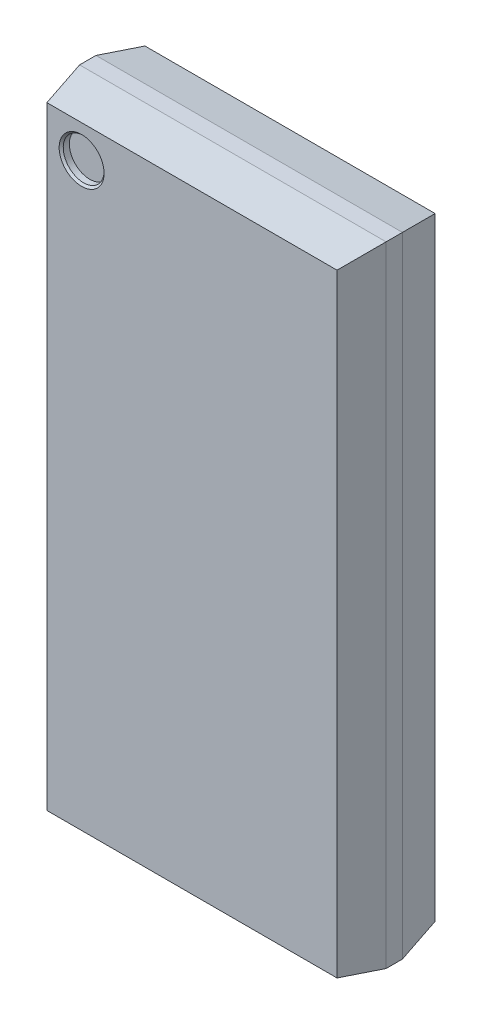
ISO-10303-21;
HEADER;
FILE_DESCRIPTION(('STEP AP214'),'2;1');
FILE_NAME('part.step','',(''),(''),'','','');
FILE_SCHEMA(('AUTOMOTIVE_DESIGN { 1 0 10303 214 1 1 1 1 }'));
ENDSEC;
DATA;
#1=APPLICATION_CONTEXT('core data for automotive mechanical design processes');
#2=APPLICATION_PROTOCOL_DEFINITION('international standard','automotive_design',2000,#1);
#3=PRODUCT_CONTEXT('',#1,'mechanical');
#4=PRODUCT('Part','Part','',(#3));
#5=PRODUCT_RELATED_PRODUCT_CATEGORY('part','',(#4));
#6=PRODUCT_DEFINITION_FORMATION('','',#4);
#7=PRODUCT_DEFINITION_CONTEXT('part definition',#1,'design');
#8=PRODUCT_DEFINITION('design','',#6,#7);
#9=PRODUCT_DEFINITION_SHAPE('','',#8);
#10=(LENGTH_UNIT() NAMED_UNIT(*) SI_UNIT(.MILLI.,.METRE.));
#11=(NAMED_UNIT(*) PLANE_ANGLE_UNIT() SI_UNIT($,.RADIAN.));
#12=(NAMED_UNIT(*) SI_UNIT($,.STERADIAN.) SOLID_ANGLE_UNIT());
#13=UNCERTAINTY_MEASURE_WITH_UNIT(LENGTH_MEASURE(1.E-05),#10,'distance_accuracy_value','');
#14=(GEOMETRIC_REPRESENTATION_CONTEXT(3) GLOBAL_UNCERTAINTY_ASSIGNED_CONTEXT((#13)) GLOBAL_UNIT_ASSIGNED_CONTEXT((#10,
#11,#12)) REPRESENTATION_CONTEXT('',''));
#15=CARTESIAN_POINT('',(0.,0.,0.));
#16=DIRECTION('',(0.,0.,1.));
#17=DIRECTION('',(1.,0.,0.));
#18=AXIS2_PLACEMENT_3D('',#15,#16,#17);
#19=CARTESIAN_POINT('',(-2.7000000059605,6.5649999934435,2.4));
#20=DIRECTION('',(0.,0.,1.));
#21=DIRECTION('',(1.,0.,0.));
#22=AXIS2_PLACEMENT_3D('',#19,#20,#21);
#23=PLANE('',#22);
#24=CARTESIAN_POINT('',(-2.7000000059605,6.5649999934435,2.4));
#25=DIRECTION('',(0.,0.,1.));
#26=DIRECTION('',(1.,0.,0.));
#27=AXIS2_PLACEMENT_3D('',#24,#25,#26);
#28=CIRCLE('',#27,0.5);
#29=CARTESIAN_POINT('',(-2.2000000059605,6.5649999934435,2.4));
#30=VERTEX_POINT('',#29);
#31=EDGE_CURVE('E20',#30,#30,#28,.T.);
#32=ORIENTED_EDGE('',*,*,#31,.T.);
#33=EDGE_LOOP('',(#32));
#34=FACE_BOUND('',#33,.T.);
#35=ADVANCED_FACE('F17',(#34),#23,.T.);
#36=CARTESIAN_POINT('',(-2.7000000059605,6.5649999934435,2.4));
#37=DIRECTION('',(0.,0.,1.));
#38=DIRECTION('',(1.,0.,0.));
#39=AXIS2_PLACEMENT_3D('',#36,#37,#38);
#40=CYLINDRICAL_SURFACE('',#39,0.5);
#41=CARTESIAN_POINT('',(-2.7000000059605,6.5649999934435,2.55000009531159));
#42=DIRECTION('',(0.,0.,1.));
#43=DIRECTION('',(0.,-1.,0.));
#44=AXIS2_PLACEMENT_3D('',#41,#42,#43);
#45=CIRCLE('',#44,0.499999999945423);
#46=CARTESIAN_POINT('',(-2.7000000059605,6.06499999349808,2.55000009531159));
#47=VERTEX_POINT('',#46);
#48=EDGE_CURVE('E111',#47,#47,#45,.T.);
#49=ORIENTED_EDGE('',*,*,#48,.T.);
#50=EDGE_LOOP('',(#49));
#51=FACE_BOUND('',#50,.T.);
#52=ORIENTED_EDGE('',*,*,#31,.F.);
#53=EDGE_LOOP('',(#52));
#54=FACE_BOUND('',#53,.T.);
#55=ADVANCED_FACE('F122',(#51,#54),#40,.F.);
#56=CARTESIAN_POINT('',(-2.7000000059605,6.5649999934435,2.60000009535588));
#57=DIRECTION('',(0.,0.,1.));
#58=DIRECTION('',(1.,0.,0.));
#59=AXIS2_PLACEMENT_3D('',#56,#57,#58);
#60=CONICAL_SURFACE('',#59,0.550000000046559,0.785398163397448);
#61=CARTESIAN_POINT('',(-2.7000000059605,6.5649999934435,2.60000009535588));
#62=DIRECTION('',(0.,0.,1.));
#63=DIRECTION('',(1.,0.,0.));
#64=AXIS2_PLACEMENT_3D('',#61,#62,#63);
#65=CIRCLE('',#64,0.550000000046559);
#66=CARTESIAN_POINT('',(-2.15000000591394,6.5649999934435,2.60000009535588));
#67=VERTEX_POINT('',#66);
#68=EDGE_CURVE('E101',#67,#67,#65,.F.);
#69=ORIENTED_EDGE('',*,*,#68,.F.);
#70=EDGE_LOOP('',(#69));
#71=FACE_BOUND('',#70,.T.);
#72=ORIENTED_EDGE('',*,*,#48,.F.);
#73=EDGE_LOOP('',(#72));
#74=FACE_BOUND('',#73,.T.);
#75=ADVANCED_FACE('F119',(#71,#74),#60,.F.);
#76=CARTESIAN_POINT('',(-3.7500000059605,7.5649999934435,2.600000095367));
#77=DIRECTION('',(0.,0.,1.));
#78=DIRECTION('',(1.,0.,0.));
#79=AXIS2_PLACEMENT_3D('',#76,#77,#78);
#80=PLANE('',#79);
#81=ORIENTED_EDGE('',*,*,#68,.T.);
#82=EDGE_LOOP('',(#81));
#83=FACE_BOUND('',#82,.T.);
#84=DIRECTION('',(0.,1.,0.));
#85=VECTOR('',#84,1.);
#86=CARTESIAN_POINT('',(-3.5500000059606,7.5649999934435,2.60000009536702));
#87=LINE('',#86,#85);
#88=CARTESIAN_POINT('',(-3.55000000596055,7.36499999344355,2.60000009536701));
#89=VERTEX_POINT('',#88);
#90=CARTESIAN_POINT('',(-3.55000000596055,-7.63499962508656,2.60000009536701));
#91=VERTEX_POINT('',#90);
#92=EDGE_CURVE('E97',#89,#91,#87,.F.);
#93=ORIENTED_EDGE('',*,*,#92,.T.);
#94=DIRECTION('',(1.,0.,0.));
#95=VECTOR('',#94,1.);
#96=CARTESIAN_POINT('',(-3.5500000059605,-7.6349996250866,2.60000009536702));
#97=LINE('',#96,#95);
#98=CARTESIAN_POINT('',(3.54999999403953,-7.63499962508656,2.60000009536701));
#99=VERTEX_POINT('',#98);
#100=EDGE_CURVE('E93',#99,#91,#97,.F.);
#101=ORIENTED_EDGE('',*,*,#100,.F.);
#102=DIRECTION('',(0.,1.,0.));
#103=VECTOR('',#102,1.);
#104=CARTESIAN_POINT('',(3.5499999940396,7.5649999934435,2.60000009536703));
#105=LINE('',#104,#103);
#106=CARTESIAN_POINT('',(3.54999999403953,7.36499999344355,2.60000009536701));
#107=VERTEX_POINT('',#106);
#108=EDGE_CURVE('E84',#107,#99,#105,.F.);
#109=ORIENTED_EDGE('',*,*,#108,.F.);
#110=DIRECTION('',(1.,0.,0.));
#111=VECTOR('',#110,1.);
#112=CARTESIAN_POINT('',(-3.5500000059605,7.3649999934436,2.60000009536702));
#113=LINE('',#112,#111);
#114=EDGE_CURVE('E79',#107,#89,#113,.F.);
#115=ORIENTED_EDGE('',*,*,#114,.T.);
#116=EDGE_LOOP('',(#93,#101,#109,#115));
#117=FACE_BOUND('',#116,.T.);
#118=ADVANCED_FACE('F96',(#83,#117),#80,.T.);
#119=CARTESIAN_POINT('',(-3.5500000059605,-7.7349996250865,2.100000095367));
#120=DIRECTION('',(0.,-0.980580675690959,0.196116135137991));
#121=DIRECTION('',(0.,-0.196116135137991,-0.980580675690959));
#122=AXIS2_PLACEMENT_3D('',#119,#120,#121);
#123=PLANE('',#122);
#124=DIRECTION('',(1.,0.,0.));
#125=VECTOR('',#124,1.);
#126=CARTESIAN_POINT('',(-3.7500000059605,-7.8349996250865,1.60000009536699));
#127=LINE('',#126,#125);
#128=CARTESIAN_POINT('',(3.74999999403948,-7.83499962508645,1.60000009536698));
#129=VERTEX_POINT('',#128);
#130=CARTESIAN_POINT('',(-3.75000000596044,-7.83499962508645,1.60000009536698));
#131=VERTEX_POINT('',#130);
#132=EDGE_CURVE('E105',#129,#131,#127,.F.);
#133=ORIENTED_EDGE('',*,*,#132,.F.);
#134=DIRECTION('',(0.192450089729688,-0.192450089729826,-0.962250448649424));
#135=VECTOR('',#134,1.);
#136=CARTESIAN_POINT('',(3.5499999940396,-7.63499962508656,2.60000009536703));
#137=LINE('',#136,#135);
#138=EDGE_CURVE('E89',#99,#129,#137,.T.);
#139=ORIENTED_EDGE('',*,*,#138,.F.);
#140=ORIENTED_EDGE('',*,*,#100,.T.);
#141=DIRECTION('',(-0.192450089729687,-0.192450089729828,-0.962250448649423));
#142=VECTOR('',#141,1.);
#143=CARTESIAN_POINT('',(-3.5500000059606,-7.63499962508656,2.60000009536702));
#144=LINE('',#143,#142);
#145=EDGE_CURVE('E362',#91,#131,#144,.T.);
#146=ORIENTED_EDGE('',*,*,#145,.T.);
#147=EDGE_LOOP('',(#133,#139,#140,#146));
#148=FACE_BOUND('',#147,.T.);
#149=ADVANCED_FACE('F104',(#148),#123,.T.);
#150=CARTESIAN_POINT('',(3.6499999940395,7.5649999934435,2.100000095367));
#151=DIRECTION('',(0.980580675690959,0.,0.196116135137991));
#152=DIRECTION('',(0.196116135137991,0.,-0.980580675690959));
#153=AXIS2_PLACEMENT_3D('',#150,#151,#152);
#154=PLANE('',#153);
#155=ORIENTED_EDGE('',*,*,#138,.T.);
#156=DIRECTION('',(0.,1.,0.));
#157=VECTOR('',#156,1.);
#158=CARTESIAN_POINT('',(3.7499999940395,7.5649999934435,1.60000009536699));
#159=LINE('',#158,#157);
#160=CARTESIAN_POINT('',(3.74999999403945,7.56499999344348,1.60000009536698));
#161=VERTEX_POINT('',#160);
#162=EDGE_CURVE('E358',#161,#129,#159,.F.);
#163=ORIENTED_EDGE('',*,*,#162,.F.);
#164=DIRECTION('',(-0.192450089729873,-0.192450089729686,0.962250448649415));
#165=VECTOR('',#164,1.);
#166=CARTESIAN_POINT('',(3.7499999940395,7.5649999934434,1.60000009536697));
#167=LINE('',#166,#165);
#168=EDGE_CURVE('E91',#161,#107,#167,.T.);
#169=ORIENTED_EDGE('',*,*,#168,.T.);
#170=ORIENTED_EDGE('',*,*,#108,.T.);
#171=EDGE_LOOP('',(#155,#163,#169,#170));
#172=FACE_BOUND('',#171,.T.);
#173=ADVANCED_FACE('F86',(#172),#154,.T.);
#174=CARTESIAN_POINT('',(-3.5500000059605,7.4649999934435,2.100000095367));
#175=DIRECTION('',(0.,-0.980580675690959,-0.196116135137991));
#176=DIRECTION('',(0.,0.196116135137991,-0.980580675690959));
#177=AXIS2_PLACEMENT_3D('',#174,#175,#176);
#178=PLANE('',#177);
#179=DIRECTION('',(1.,0.,0.));
#180=VECTOR('',#179,1.);
#181=CARTESIAN_POINT('',(-3.7500000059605,7.5649999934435,1.60000009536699));
#182=LINE('',#181,#180);
#183=CARTESIAN_POINT('',(-3.75000000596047,7.56499999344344,1.60000009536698));
#184=VERTEX_POINT('',#183);
#185=EDGE_CURVE('E330',#161,#184,#182,.F.);
#186=ORIENTED_EDGE('',*,*,#185,.T.);
#187=DIRECTION('',(0.192450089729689,-0.192450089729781,0.962250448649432));
#188=VECTOR('',#187,1.);
#189=CARTESIAN_POINT('',(-3.7500000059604,7.56499999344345,1.60000009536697));
#190=LINE('',#189,#188);
#191=EDGE_CURVE('E332',#184,#89,#190,.T.);
#192=ORIENTED_EDGE('',*,*,#191,.T.);
#193=ORIENTED_EDGE('',*,*,#114,.F.);
#194=ORIENTED_EDGE('',*,*,#168,.F.);
#195=EDGE_LOOP('',(#186,#192,#193,#194));
#196=FACE_BOUND('',#195,.T.);
#197=ADVANCED_FACE('F177',(#196),#178,.F.);
#198=CARTESIAN_POINT('',(-3.6500000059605,7.5649999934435,2.100000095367));
#199=DIRECTION('',(0.980580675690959,0.,-0.196116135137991));
#200=DIRECTION('',(-0.196116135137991,0.,-0.980580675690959));
#201=AXIS2_PLACEMENT_3D('',#198,#199,#200);
#202=PLANE('',#201);
#203=DIRECTION('',(0.,1.,0.));
#204=VECTOR('',#203,1.);
#205=CARTESIAN_POINT('',(-3.7500000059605,7.5649999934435,1.60000009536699));
#206=LINE('',#205,#204);
#207=EDGE_CURVE('E334',#184,#131,#206,.F.);
#208=ORIENTED_EDGE('',*,*,#207,.T.);
#209=ORIENTED_EDGE('',*,*,#145,.F.);
#210=ORIENTED_EDGE('',*,*,#92,.F.);
#211=ORIENTED_EDGE('',*,*,#191,.F.);
#212=EDGE_LOOP('',(#208,#209,#210,#211));
#213=FACE_BOUND('',#212,.T.);
#214=ADVANCED_FACE('F173',(#213),#202,.F.);
#215=CARTESIAN_POINT('',(-3.7500000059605,-7.8349996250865,0.2));
#216=DIRECTION('',(0.,-1.,0.));
#217=DIRECTION('',(1.,0.,0.));
#218=AXIS2_PLACEMENT_3D('',#215,#216,#217);
#219=PLANE('',#218);
#220=DIRECTION('',(1.,0.,0.));
#221=VECTOR('',#220,1.);
#222=CARTESIAN_POINT('',(-3.5500000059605,-7.8349996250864,1.20000000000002));
#223=LINE('',#222,#221);
#224=CARTESIAN_POINT('',(-3.75000000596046,-7.83499962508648,1.20000000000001));
#225=VERTEX_POINT('',#224);
#226=CARTESIAN_POINT('',(3.74999999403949,-7.83499962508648,1.20000000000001));
#227=VERTEX_POINT('',#226);
#228=EDGE_CURVE('E343',#225,#227,#223,.T.);
#229=ORIENTED_EDGE('',*,*,#228,.T.);
#230=DIRECTION('',(0.,0.,1.));
#231=VECTOR('',#230,1.);
#232=CARTESIAN_POINT('',(3.7499999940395,-7.8349996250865,0.2));
#233=LINE('',#232,#231);
#234=EDGE_CURVE('E356',#129,#227,#233,.F.);
#235=ORIENTED_EDGE('',*,*,#234,.F.);
#236=ORIENTED_EDGE('',*,*,#132,.T.);
#237=DIRECTION('',(0.,0.,1.));
#238=VECTOR('',#237,1.);
#239=CARTESIAN_POINT('',(-3.7500000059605,-7.8349996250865,0.2));
#240=LINE('',#239,#238);
#241=EDGE_CURVE('E344',#131,#225,#240,.F.);
#242=ORIENTED_EDGE('',*,*,#241,.T.);
#243=EDGE_LOOP('',(#229,#235,#236,#242));
#244=FACE_BOUND('',#243,.T.);
#245=ADVANCED_FACE('F169',(#244),#219,.T.);
#246=CARTESIAN_POINT('',(3.7499999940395,7.5649999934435,0.2));
#247=DIRECTION('',(1.,0.,0.));
#248=DIRECTION('',(0.,1.,0.));
#249=AXIS2_PLACEMENT_3D('',#246,#247,#248);
#250=PLANE('',#249);
#251=ORIENTED_EDGE('',*,*,#234,.T.);
#252=DIRECTION('',(0.,1.,0.));
#253=VECTOR('',#252,1.);
#254=CARTESIAN_POINT('',(3.7499999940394,7.5649999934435,1.20000000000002));
#255=LINE('',#254,#253);
#256=CARTESIAN_POINT('',(3.74999999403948,7.56499999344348,1.20000000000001));
#257=VERTEX_POINT('',#256);
#258=EDGE_CURVE('E368',#227,#257,#255,.T.);
#259=ORIENTED_EDGE('',*,*,#258,.T.);
#260=DIRECTION('',(0.,0.,1.));
#261=VECTOR('',#260,1.);
#262=CARTESIAN_POINT('',(3.7499999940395,7.5649999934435,0.2));
#263=LINE('',#262,#261);
#264=EDGE_CURVE('E335',#257,#161,#263,.T.);
#265=ORIENTED_EDGE('',*,*,#264,.T.);
#266=ORIENTED_EDGE('',*,*,#162,.T.);
#267=EDGE_LOOP('',(#251,#259,#265,#266));
#268=FACE_BOUND('',#267,.T.);
#269=ADVANCED_FACE('F165',(#268),#250,.T.);
#270=CARTESIAN_POINT('',(-3.7500000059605,7.5649999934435,0.2));
#271=DIRECTION('',(0.,-1.,0.));
#272=DIRECTION('',(1.,0.,0.));
#273=AXIS2_PLACEMENT_3D('',#270,#271,#272);
#274=PLANE('',#273);
#275=ORIENTED_EDGE('',*,*,#264,.F.);
#276=DIRECTION('',(1.,0.,0.));
#277=VECTOR('',#276,1.);
#278=CARTESIAN_POINT('',(-3.5500000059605,7.5649999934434,1.20000000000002));
#279=LINE('',#278,#277);
#280=CARTESIAN_POINT('',(-3.75000000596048,7.56499999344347,1.20000000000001));
#281=VERTEX_POINT('',#280);
#282=EDGE_CURVE('E340',#281,#257,#279,.T.);
#283=ORIENTED_EDGE('',*,*,#282,.F.);
#284=DIRECTION('',(0.,0.,1.));
#285=VECTOR('',#284,1.);
#286=CARTESIAN_POINT('',(-3.7500000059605,7.56499999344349,0.2));
#287=LINE('',#286,#285);
#288=EDGE_CURVE('E338',#281,#184,#287,.T.);
#289=ORIENTED_EDGE('',*,*,#288,.T.);
#290=ORIENTED_EDGE('',*,*,#185,.F.);
#291=EDGE_LOOP('',(#275,#283,#289,#290));
#292=FACE_BOUND('',#291,.T.);
#293=ADVANCED_FACE('F161',(#292),#274,.F.);
#294=CARTESIAN_POINT('',(-3.7500000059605,7.5649999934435,0.2));
#295=DIRECTION('',(1.,0.,0.));
#296=DIRECTION('',(0.,1.,0.));
#297=AXIS2_PLACEMENT_3D('',#294,#295,#296);
#298=PLANE('',#297);
#299=DIRECTION('',(0.,1.,0.));
#300=VECTOR('',#299,1.);
#301=CARTESIAN_POINT('',(-3.7500000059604,7.5649999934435,1.20000000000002));
#302=LINE('',#301,#300);
#303=EDGE_CURVE('E365',#225,#281,#302,.T.);
#304=ORIENTED_EDGE('',*,*,#303,.F.);
#305=ORIENTED_EDGE('',*,*,#241,.F.);
#306=ORIENTED_EDGE('',*,*,#207,.F.);
#307=ORIENTED_EDGE('',*,*,#288,.F.);
#308=EDGE_LOOP('',(#304,#305,#306,#307));
#309=FACE_BOUND('',#308,.T.);
#310=ADVANCED_FACE('F157',(#309),#298,.F.);
#311=CARTESIAN_POINT('',(-3.5500000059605,-7.7349996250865,0.7));
#312=DIRECTION('',(0.,0.980580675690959,0.196116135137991));
#313=DIRECTION('',(0.,-0.196116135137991,0.980580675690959));
#314=AXIS2_PLACEMENT_3D('',#311,#312,#313);
#315=PLANE('',#314);
#316=DIRECTION('',(0.192450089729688,-0.192450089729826,0.962250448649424));
#317=VECTOR('',#316,1.);
#318=CARTESIAN_POINT('',(3.5499999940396,-7.63499962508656,0.199999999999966));
#319=LINE('',#318,#317);
#320=CARTESIAN_POINT('',(3.54999999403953,-7.63499962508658,0.19999999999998));
#321=VERTEX_POINT('',#320);
#322=EDGE_CURVE('E347',#321,#227,#319,.T.);
#323=ORIENTED_EDGE('',*,*,#322,.T.);
#324=ORIENTED_EDGE('',*,*,#228,.F.);
#325=DIRECTION('',(-0.192450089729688,-0.192450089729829,0.962250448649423));
#326=VECTOR('',#325,1.);
#327=CARTESIAN_POINT('',(-3.5500000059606,-7.63499962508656,0.199999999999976));
#328=LINE('',#327,#326);
#329=CARTESIAN_POINT('',(-3.55000000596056,-7.63499962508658,0.199999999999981));
#330=VERTEX_POINT('',#329);
#331=EDGE_CURVE('E389',#330,#225,#328,.T.);
#332=ORIENTED_EDGE('',*,*,#331,.F.);
#333=DIRECTION('',(1.,0.,0.));
#334=VECTOR('',#333,1.);
#335=CARTESIAN_POINT('',(-3.7500000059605,-7.63499962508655,0.2));
#336=LINE('',#335,#334);
#337=EDGE_CURVE('E383',#330,#321,#336,.T.);
#338=ORIENTED_EDGE('',*,*,#337,.T.);
#339=EDGE_LOOP('',(#323,#324,#332,#338));
#340=FACE_BOUND('',#339,.T.);
#341=ADVANCED_FACE('F153',(#340),#315,.F.);
#342=CARTESIAN_POINT('',(3.6499999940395,7.5649999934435,0.7));
#343=DIRECTION('',(-0.980580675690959,0.,0.196116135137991));
#344=DIRECTION('',(0.196116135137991,0.,0.980580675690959));
#345=AXIS2_PLACEMENT_3D('',#342,#343,#344);
#346=PLANE('',#345);
#347=ORIENTED_EDGE('',*,*,#322,.F.);
#348=DIRECTION('',(0.,1.,0.));
#349=VECTOR('',#348,1.);
#350=CARTESIAN_POINT('',(3.5499999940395,7.5649999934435,0.2));
#351=LINE('',#350,#349);
#352=CARTESIAN_POINT('',(3.54999999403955,7.36499999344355,0.199999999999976));
#353=VERTEX_POINT('',#352);
#354=EDGE_CURVE('E377',#321,#353,#351,.T.);
#355=ORIENTED_EDGE('',*,*,#354,.T.);
#356=DIRECTION('',(-0.192450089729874,-0.192450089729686,-0.962250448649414));
#357=VECTOR('',#356,1.);
#358=CARTESIAN_POINT('',(3.7499999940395,7.5649999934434,1.20000000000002));
#359=LINE('',#358,#357);
#360=EDGE_CURVE('E371',#257,#353,#359,.T.);
#361=ORIENTED_EDGE('',*,*,#360,.F.);
#362=ORIENTED_EDGE('',*,*,#258,.F.);
#363=EDGE_LOOP('',(#347,#355,#361,#362));
#364=FACE_BOUND('',#363,.T.);
#365=ADVANCED_FACE('F149',(#364),#346,.F.);
#366=CARTESIAN_POINT('',(-3.5500000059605,7.4649999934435,0.7));
#367=DIRECTION('',(0.,0.980580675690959,-0.196116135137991));
#368=DIRECTION('',(0.,0.196116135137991,0.980580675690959));
#369=AXIS2_PLACEMENT_3D('',#366,#367,#368);
#370=PLANE('',#369);
#371=DIRECTION('',(0.192450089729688,-0.192450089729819,-0.962250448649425));
#372=VECTOR('',#371,1.);
#373=CARTESIAN_POINT('',(-3.7500000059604,7.56499999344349,1.20000000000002));
#374=LINE('',#373,#372);
#375=CARTESIAN_POINT('',(-3.55000000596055,7.36499999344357,0.199999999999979));
#376=VERTEX_POINT('',#375);
#377=EDGE_CURVE('E34',#281,#376,#374,.T.);
#378=ORIENTED_EDGE('',*,*,#377,.F.);
#379=ORIENTED_EDGE('',*,*,#282,.T.);
#380=ORIENTED_EDGE('',*,*,#360,.T.);
#381=DIRECTION('',(1.,0.,0.));
#382=VECTOR('',#381,1.);
#383=CARTESIAN_POINT('',(-3.7500000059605,7.36499999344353,0.2));
#384=LINE('',#383,#382);
#385=EDGE_CURVE('E26',#353,#376,#384,.F.);
#386=ORIENTED_EDGE('',*,*,#385,.T.);
#387=EDGE_LOOP('',(#378,#379,#380,#386));
#388=FACE_BOUND('',#387,.T.);
#389=ADVANCED_FACE('F143',(#388),#370,.T.);
#390=CARTESIAN_POINT('',(-3.6500000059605,7.5649999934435,0.7));
#391=DIRECTION('',(-0.980580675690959,0.,-0.196116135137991));
#392=DIRECTION('',(-0.196116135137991,0.,0.980580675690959));
#393=AXIS2_PLACEMENT_3D('',#390,#391,#392);
#394=PLANE('',#393);
#395=ORIENTED_EDGE('',*,*,#331,.T.);
#396=ORIENTED_EDGE('',*,*,#303,.T.);
#397=ORIENTED_EDGE('',*,*,#377,.T.);
#398=DIRECTION('',(0.,1.,0.));
#399=VECTOR('',#398,1.);
#400=CARTESIAN_POINT('',(-3.55000000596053,7.5649999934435,0.2));
#401=LINE('',#400,#399);
#402=EDGE_CURVE('E11',#376,#330,#401,.F.);
#403=ORIENTED_EDGE('',*,*,#402,.T.);
#404=EDGE_LOOP('',(#395,#396,#397,#403));
#405=FACE_BOUND('',#404,.T.);
#406=ADVANCED_FACE('F137',(#405),#394,.T.);
#407=CARTESIAN_POINT('',(-3.7500000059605,7.5649999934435,0.2));
#408=DIRECTION('',(0.,0.,1.));
#409=DIRECTION('',(1.,0.,0.));
#410=AXIS2_PLACEMENT_3D('',#407,#408,#409);
#411=PLANE('',#410);
#412=ORIENTED_EDGE('',*,*,#385,.F.);
#413=ORIENTED_EDGE('',*,*,#354,.F.);
#414=ORIENTED_EDGE('',*,*,#337,.F.);
#415=ORIENTED_EDGE('',*,*,#402,.F.);
#416=EDGE_LOOP('',(#412,#413,#414,#415));
#417=FACE_BOUND('',#416,.T.);
#418=ADVANCED_FACE('F135',(#417),#411,.F.);
#419=CLOSED_SHELL('',(#35,#55,#75,#118,#149,#173,#197,#214,#245,#269,#293,#310,#341,#365,#389,
#406,#418));
#420=MANIFOLD_SOLID_BREP('B1',#419);
#421=ADVANCED_BREP_SHAPE_REPRESENTATION('',(#18,#420),#14);
#422=SHAPE_DEFINITION_REPRESENTATION(#9,#421);
ENDSEC;
END-ISO-10303-21;
